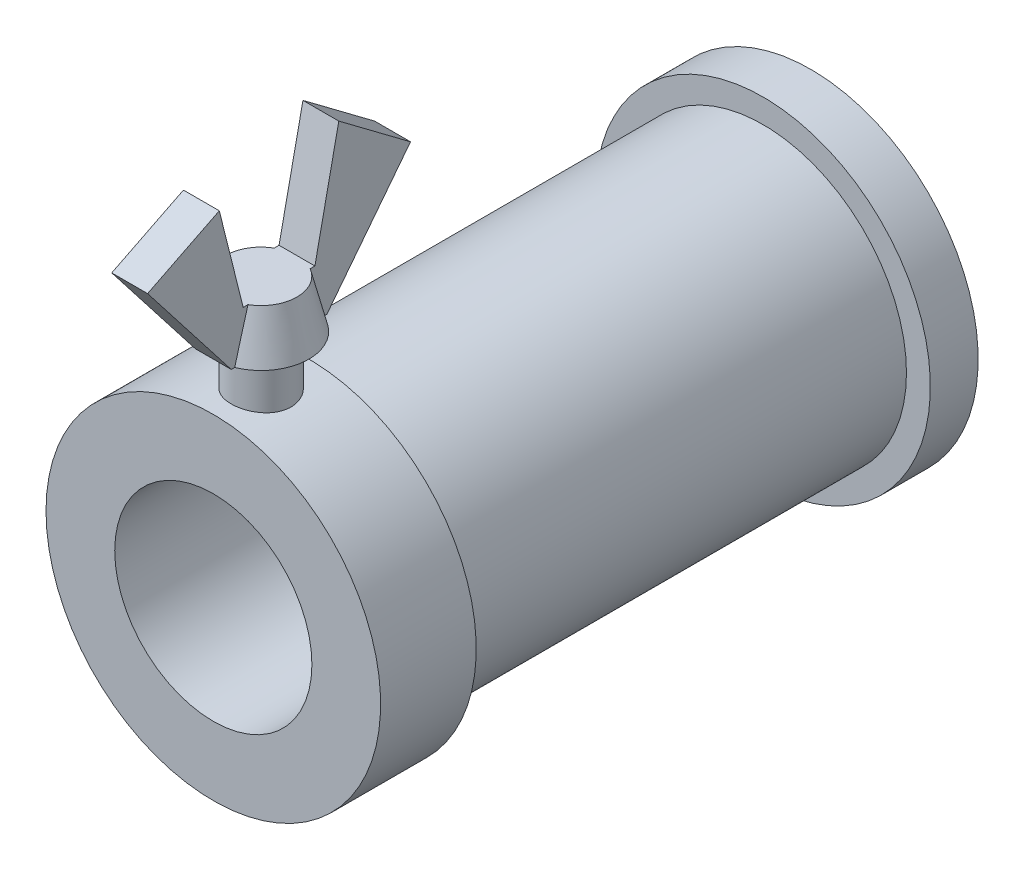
ISO-10303-21;
HEADER;
FILE_DESCRIPTION(('STEP AP214'),'2;1');
FILE_NAME('part.step','',(''),(''),'','','');
FILE_SCHEMA(('AUTOMOTIVE_DESIGN { 1 0 10303 214 1 1 1 1 }'));
ENDSEC;
DATA;
#1=APPLICATION_CONTEXT('core data for automotive mechanical design processes');
#2=APPLICATION_PROTOCOL_DEFINITION('international standard','automotive_design',2000,#1);
#3=PRODUCT_CONTEXT('',#1,'mechanical');
#4=PRODUCT('Part','Part','',(#3));
#5=PRODUCT_RELATED_PRODUCT_CATEGORY('part','',(#4));
#6=PRODUCT_DEFINITION_FORMATION('','',#4);
#7=PRODUCT_DEFINITION_CONTEXT('part definition',#1,'design');
#8=PRODUCT_DEFINITION('design','',#6,#7);
#9=PRODUCT_DEFINITION_SHAPE('','',#8);
#10=(LENGTH_UNIT() NAMED_UNIT(*) SI_UNIT(.MILLI.,.METRE.));
#11=(NAMED_UNIT(*) PLANE_ANGLE_UNIT() SI_UNIT($,.RADIAN.));
#12=(NAMED_UNIT(*) SI_UNIT($,.STERADIAN.) SOLID_ANGLE_UNIT());
#13=UNCERTAINTY_MEASURE_WITH_UNIT(LENGTH_MEASURE(1.E-05),#10,'distance_accuracy_value','');
#14=(GEOMETRIC_REPRESENTATION_CONTEXT(3) GLOBAL_UNCERTAINTY_ASSIGNED_CONTEXT((#13)) GLOBAL_UNIT_ASSIGNED_CONTEXT((#10,
#11,#12)) REPRESENTATION_CONTEXT('',''));
#15=CARTESIAN_POINT('',(0.,0.,0.));
#16=DIRECTION('',(0.,0.,1.));
#17=DIRECTION('',(1.,0.,0.));
#18=AXIS2_PLACEMENT_3D('',#15,#16,#17);
#19=CARTESIAN_POINT('',(0.,22.,46.));
#20=DIRECTION('',(0.,-1.,0.));
#21=DIRECTION('',(0.,0.,1.));
#22=AXIS2_PLACEMENT_3D('',#19,#20,#21);
#23=CONICAL_SURFACE('',#22,3.,0.244978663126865);
#24=CARTESIAN_POINT('',(-1.5,24.8634565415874,47.7225784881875));
#25=CARTESIAN_POINT('',(-1.5,24.7179564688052,47.7707943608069));
#26=CARTESIAN_POINT('',(-1.5,24.5722086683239,47.8182542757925));
#27=CARTESIAN_POINT('',(-1.5,24.2803109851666,47.9119099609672));
#28=CARTESIAN_POINT('',(-1.5,24.13416111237,47.9581057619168));
#29=CARTESIAN_POINT('',(-1.5,23.8415562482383,48.0494799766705));
#30=CARTESIAN_POINT('',(-1.5,23.6951012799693,48.0946584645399));
#31=CARTESIAN_POINT('',(-1.5,23.401932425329,48.1841702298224));
#32=CARTESIAN_POINT('',(-1.5,23.2552185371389,48.2285035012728));
#33=CARTESIAN_POINT('',(-1.5,22.8148083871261,48.3604319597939));
#34=CARTESIAN_POINT('',(-1.5,22.5207956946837,48.4469706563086));
#35=CARTESIAN_POINT('',(-1.5,21.9321710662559,48.617999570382));
#36=CARTESIAN_POINT('',(-1.5,21.6375591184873,48.70248974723));
#37=CARTESIAN_POINT('',(-1.5,21.1572394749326,48.8388644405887));
#38=CARTESIAN_POINT('',(-1.5,20.9716653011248,48.8912200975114));
#39=CARTESIAN_POINT('',(-1.5,20.6003702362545,48.9954030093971));
#40=CARTESIAN_POINT('',(-1.5,20.4146493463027,49.0472302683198));
#41=CARTESIAN_POINT('',(-1.5,19.8572788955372,49.2020403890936));
#42=CARTESIAN_POINT('',(-1.5,19.4854412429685,49.3043460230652));
#43=CARTESIAN_POINT('',(-1.5,18.6318117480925,49.5375328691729));
#44=CARTESIAN_POINT('',(-1.5,18.1498946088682,49.6679546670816));
#45=CARTESIAN_POINT('',(-1.5,17.1856155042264,49.9271461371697));
#46=CARTESIAN_POINT('',(-1.5,16.7032535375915,50.0559158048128));
#47=CARTESIAN_POINT('',(-1.5,15.7382755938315,50.3121964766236));
#48=CARTESIAN_POINT('',(-1.5,15.2556596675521,50.439707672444));
#49=CARTESIAN_POINT('',(-1.5,14.2901756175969,50.6937568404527));
#50=CARTESIAN_POINT('',(-1.5,13.8073074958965,50.8202948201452));
#51=CARTESIAN_POINT('',(-1.5,13.3243477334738,50.9464797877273));
#52=B_SPLINE_CURVE_WITH_KNOTS('',3,(#24,#25,#26,#27,#28,#29,#30,#31,#32,#33,#34,#35,#36,#37,#38,
#39,#40,#41,#42,#43,#44,#45,#46,#47,#48,#49,#50,#51),.UNSPECIFIED.,.F.,.F.,(4,2,2,2,2,2,2,2,2,2,
2,2,2,4),(0.,0.459836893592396,0.919662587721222,1.3794546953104,1.83925004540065,
2.75869016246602,3.6781485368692,4.25660258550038,4.8350522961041,5.99201310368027,
7.48976928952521,8.98752958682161,10.4850581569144,11.982575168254),.UNSPECIFIED.);
#53=CARTESIAN_POINT('',(-1.5,22.,48.5980762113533));
#54=VERTEX_POINT('',#53);
#55=CARTESIAN_POINT('',(-1.5,18.,49.7080992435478));
#56=VERTEX_POINT('',#55);
#57=EDGE_CURVE('E292',#54,#56,#52,.T.);
#58=ORIENTED_EDGE('',*,*,#57,.F.);
#59=CARTESIAN_POINT('',(0.,22.,46.));
#60=DIRECTION('',(0.,-1.,0.));
#61=DIRECTION('',(0.,0.,1.));
#62=AXIS2_PLACEMENT_3D('',#59,#60,#61);
#63=CIRCLE('',#62,3.);
#64=CARTESIAN_POINT('',(-1.5,22.,43.4019237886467));
#65=VERTEX_POINT('',#64);
#66=EDGE_CURVE('E189',#54,#65,#63,.T.);
#67=ORIENTED_EDGE('',*,*,#66,.T.);
#68=CARTESIAN_POINT('',(-1.5,13.3243477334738,41.0535202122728));
#69=CARTESIAN_POINT('',(-1.5,13.8073880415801,41.1797262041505));
#70=CARTESIAN_POINT('',(-1.5,14.2903366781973,41.3062853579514));
#71=CARTESIAN_POINT('',(-1.5,15.2559717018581,41.5603746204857));
#72=CARTESIAN_POINT('',(-1.5,15.7386580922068,41.6879047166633));
#73=CARTESIAN_POINT('',(-1.5,16.7036262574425,41.9441835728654));
#74=CARTESIAN_POINT('',(-1.5,17.1859080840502,42.0729321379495));
#75=CARTESIAN_POINT('',(-1.5,18.1500361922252,42.3320837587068));
#76=CARTESIAN_POINT('',(-1.5,18.6318824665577,42.4624868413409));
#77=CARTESIAN_POINT('',(-1.5,19.5950544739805,42.7255967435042));
#78=CARTESIAN_POINT('',(-1.5,20.0763800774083,42.8583040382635));
#79=CARTESIAN_POINT('',(-1.5,21.038107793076,43.12697047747));
#80=CARTESIAN_POINT('',(-1.5,21.5185099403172,43.2629294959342));
#81=CARTESIAN_POINT('',(-1.5,22.2380729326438,43.4706495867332));
#82=CARTESIAN_POINT('',(-1.5,22.4777770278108,43.5405268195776));
#83=CARTESIAN_POINT('',(-1.5,22.9567027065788,43.6819038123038));
#84=CARTESIAN_POINT('',(-1.5,23.1959242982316,43.7534035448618));
#85=CARTESIAN_POINT('',(-1.5,23.6737573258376,43.898533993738));
#86=CARTESIAN_POINT('',(-1.5,23.9123686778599,43.972164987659));
#87=CARTESIAN_POINT('',(-1.5,24.2696087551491,44.0847837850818));
#88=CARTESIAN_POINT('',(-1.5,24.3885793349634,44.1226865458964));
#89=CARTESIAN_POINT('',(-1.5,24.62624120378,44.199363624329));
#90=CARTESIAN_POINT('',(-1.5,24.7449324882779,44.2381379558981));
#91=CARTESIAN_POINT('',(-1.5,24.8634565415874,44.2774215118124));
#92=B_SPLINE_CURVE_WITH_KNOTS('',3,(#68,#69,#70,#71,#72,#73,#74,#75,#76,#77,#78,#79,#80,#81,#82,
#83,#84,#85,#86,#87,#88,#89,#90,#91),.UNSPECIFIED.,.F.,.F.,(4,2,2,2,2,2,2,2,2,2,2,4),(0.,
1.49776676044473,2.99551418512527,4.49302590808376,5.99056206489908,7.48841083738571,
8.9862016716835,9.7352420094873,10.4842697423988,11.2333954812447,11.6079796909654,
11.9825699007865),.UNSPECIFIED.);
#93=CARTESIAN_POINT('',(-1.5,18.,42.2919007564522));
#94=VERTEX_POINT('',#93);
#95=EDGE_CURVE('E218',#94,#65,#92,.T.);
#96=ORIENTED_EDGE('',*,*,#95,.F.);
#97=CARTESIAN_POINT('',(0.,18.,46.));
#98=DIRECTION('',(0.,-1.,0.));
#99=DIRECTION('',(0.,0.,1.));
#100=AXIS2_PLACEMENT_3D('',#97,#98,#99);
#101=CIRCLE('',#100,4.);
#102=EDGE_CURVE('E187',#56,#94,#101,.T.);
#103=ORIENTED_EDGE('',*,*,#102,.F.);
#104=EDGE_LOOP('',(#58,#67,#96,#103));
#105=FACE_BOUND('',#104,.T.);
#106=ADVANCED_FACE('F14',(#105),#23,.T.);
#107=CARTESIAN_POINT('',(-14.,0.,0.));
#108=DIRECTION('',(0.,0.,1.));
#109=DIRECTION('',(1.,0.,0.));
#110=AXIS2_PLACEMENT_3D('',#107,#108,#109);
#111=PLANE('',#110);
#112=CARTESIAN_POINT('',(0.,0.,0.));
#113=DIRECTION('',(0.,0.,-1.));
#114=DIRECTION('',(-1.,0.,0.));
#115=AXIS2_PLACEMENT_3D('',#112,#113,#114);
#116=CIRCLE('',#115,8.25);
#117=CARTESIAN_POINT('',(-8.25,0.,0.));
#118=VERTEX_POINT('',#117);
#119=EDGE_CURVE('E215',#118,#118,#116,.T.);
#120=ORIENTED_EDGE('',*,*,#119,.F.);
#121=EDGE_LOOP('',(#120));
#122=FACE_BOUND('',#121,.T.);
#123=CARTESIAN_POINT('',(0.,0.,0.));
#124=DIRECTION('',(0.,0.,-1.));
#125=DIRECTION('',(-1.,0.,0.));
#126=AXIS2_PLACEMENT_3D('',#123,#124,#125);
#127=CIRCLE('',#126,14.);
#128=CARTESIAN_POINT('',(-14.,0.,0.));
#129=VERTEX_POINT('',#128);
#130=EDGE_CURVE('E194',#129,#129,#127,.T.);
#131=ORIENTED_EDGE('',*,*,#130,.T.);
#132=EDGE_LOOP('',(#131));
#133=FACE_BOUND('',#132,.T.);
#134=ADVANCED_FACE('F16',(#122,#133),#111,.F.);
#135=CARTESIAN_POINT('',(0.,0.,-10.));
#136=DIRECTION('',(0.,0.,-1.));
#137=DIRECTION('',(-1.,0.,0.));
#138=AXIS2_PLACEMENT_3D('',#135,#136,#137);
#139=CYLINDRICAL_SURFACE('',#138,8.25);
#140=CARTESIAN_POINT('',(0.,0.,50.));
#141=DIRECTION('',(0.,0.,-1.));
#142=DIRECTION('',(-1.,0.,0.));
#143=AXIS2_PLACEMENT_3D('',#140,#141,#142);
#144=CIRCLE('',#143,8.25);
#145=CARTESIAN_POINT('',(-8.25,0.,50.));
#146=VERTEX_POINT('',#145);
#147=EDGE_CURVE('E212',#146,#146,#144,.T.);
#148=ORIENTED_EDGE('',*,*,#147,.F.);
#149=EDGE_LOOP('',(#148));
#150=FACE_BOUND('',#149,.T.);
#151=ORIENTED_EDGE('',*,*,#119,.T.);
#152=EDGE_LOOP('',(#151));
#153=FACE_BOUND('',#152,.T.);
#154=ADVANCED_FACE('F275',(#150,#153),#139,.F.);
#155=CARTESIAN_POINT('',(-8.25,0.,50.));
#156=DIRECTION('',(0.,0.,-1.));
#157=DIRECTION('',(-1.,0.,0.));
#158=AXIS2_PLACEMENT_3D('',#155,#156,#157);
#159=PLANE('',#158);
#160=CARTESIAN_POINT('',(0.,0.,50.));
#161=DIRECTION('',(0.,0.,-1.));
#162=DIRECTION('',(-1.,0.,0.));
#163=AXIS2_PLACEMENT_3D('',#160,#161,#162);
#164=CIRCLE('',#163,14.);
#165=CARTESIAN_POINT('',(-14.,0.,50.));
#166=VERTEX_POINT('',#165);
#167=EDGE_CURVE('E209',#166,#166,#164,.T.);
#168=ORIENTED_EDGE('',*,*,#167,.F.);
#169=EDGE_LOOP('',(#168));
#170=FACE_BOUND('',#169,.T.);
#171=ORIENTED_EDGE('',*,*,#147,.T.);
#172=EDGE_LOOP('',(#171));
#173=FACE_BOUND('',#172,.T.);
#174=ADVANCED_FACE('F265',(#170,#173),#159,.F.);
#175=CARTESIAN_POINT('',(0.,0.,-10.));
#176=DIRECTION('',(0.,0.,-1.));
#177=DIRECTION('',(-1.,0.,0.));
#178=AXIS2_PLACEMENT_3D('',#175,#176,#177);
#179=CYLINDRICAL_SURFACE('',#178,14.);
#180=CARTESIAN_POINT('',(0.,14.,48.5));
#181=CARTESIAN_POINT('',(-0.139239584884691,13.9999975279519,48.4999945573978));
#182=CARTESIAN_POINT('',(-0.278551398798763,13.9979012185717,48.4883280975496));
#183=CARTESIAN_POINT('',(-0.553257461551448,13.9897405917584,48.4419958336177));
#184=CARTESIAN_POINT('',(-0.688648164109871,13.9836727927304,48.4073098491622));
#185=CARTESIAN_POINT('',(-0.951498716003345,13.9682487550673,48.316027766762));
#186=CARTESIAN_POINT('',(-1.07896532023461,13.9588953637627,48.2594506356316));
#187=CARTESIAN_POINT('',(-1.32258294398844,13.9379246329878,48.1260443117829));
#188=CARTESIAN_POINT('',(-1.43873504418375,13.9263075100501,48.0492170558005));
#189=CARTESIAN_POINT('',(-1.65770744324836,13.9019523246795,47.8766007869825));
#190=CARTESIAN_POINT('',(-1.76038642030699,13.8892044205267,47.7806338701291));
#191=CARTESIAN_POINT('',(-1.94827611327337,13.8640984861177,47.5728452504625));
#192=CARTESIAN_POINT('',(-2.03348564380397,13.851740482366,47.4610224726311));
#193=CARTESIAN_POINT('',(-2.18459604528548,13.828718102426,47.2237098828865));
#194=CARTESIAN_POINT('',(-2.2503549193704,13.8180664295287,47.098128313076));
#195=CARTESIAN_POINT('',(-2.35978878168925,13.799800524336,46.8374788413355));
#196=CARTESIAN_POINT('',(-2.40346549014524,13.7921860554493,46.7024116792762));
#197=CARTESIAN_POINT('',(-2.46704527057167,13.7809553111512,46.4281311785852));
#198=CARTESIAN_POINT('',(-2.48719373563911,13.7772977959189,46.2889764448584));
#199=CARTESIAN_POINT('',(-2.50390640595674,13.7742705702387,46.0092170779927));
#200=CARTESIAN_POINT('',(-2.50047252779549,13.7749005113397,45.8686125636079));
#201=CARTESIAN_POINT('',(-2.47031736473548,13.78033942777,45.5917111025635));
#202=CARTESIAN_POINT('',(-2.44387361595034,13.7850985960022,45.4553828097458));
#203=CARTESIAN_POINT('',(-2.3688857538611,13.7981816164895,45.1891293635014));
#204=CARTESIAN_POINT('',(-2.3203407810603,13.8065056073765,45.0592044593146));
#205=CARTESIAN_POINT('',(-2.2022526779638,13.8258332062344,44.8086255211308));
#206=CARTESIAN_POINT('',(-2.13259607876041,13.836851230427,44.6880261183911));
#207=CARTESIAN_POINT('',(-1.97434240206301,13.8603157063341,44.4601224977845));
#208=CARTESIAN_POINT('',(-1.88574357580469,13.8727622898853,44.3528195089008));
#209=CARTESIAN_POINT('',(-1.69061708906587,13.8978993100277,44.1529497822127));
#210=CARTESIAN_POINT('',(-1.58385171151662,13.9105906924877,44.0606150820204));
#211=CARTESIAN_POINT('',(-1.35622200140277,13.934623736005,43.895133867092));
#212=CARTESIAN_POINT('',(-1.23535755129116,13.9459653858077,43.8219875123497));
#213=CARTESIAN_POINT('',(-0.982729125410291,13.9660408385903,43.6969309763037));
#214=CARTESIAN_POINT('',(-0.850953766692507,13.9747718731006,43.6450433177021));
#215=CARTESIAN_POINT('',(-0.580367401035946,13.9886206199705,43.564203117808));
#216=CARTESIAN_POINT('',(-0.441557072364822,13.9937386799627,43.5352483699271));
#217=CARTESIAN_POINT('',(-0.16283898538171,13.999737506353,43.501415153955));
#218=CARTESIAN_POINT('',(-0.0229710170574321,14.0006742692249,43.496218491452));
#219=CARTESIAN_POINT('',(0.255635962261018,13.9983590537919,43.5091977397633));
#220=CARTESIAN_POINT('',(0.394375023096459,13.9951072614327,43.5273726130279));
#221=CARTESIAN_POINT('',(0.66578830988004,13.9848150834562,43.5863143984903));
#222=CARTESIAN_POINT('',(0.798498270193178,13.9778014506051,43.6269218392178));
#223=CARTESIAN_POINT('',(1.05522666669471,13.960768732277,43.7294046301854));
#224=CARTESIAN_POINT('',(1.17924455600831,13.9507494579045,43.7912813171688));
#225=CARTESIAN_POINT('',(1.4164370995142,13.9286773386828,43.9352612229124));
#226=CARTESIAN_POINT('',(1.52949072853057,13.9166051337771,44.0175607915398));
#227=CARTESIAN_POINT('',(1.74029662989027,13.8918196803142,44.1997826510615));
#228=CARTESIAN_POINT('',(1.8380476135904,13.8791063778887,44.2997064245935));
#229=CARTESIAN_POINT('',(2.01666949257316,13.8542878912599,44.5157749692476));
#230=CARTESIAN_POINT('',(2.09732417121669,13.8421918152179,44.6320997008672));
#231=CARTESIAN_POINT('',(2.237948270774,13.8201546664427,44.8768336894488));
#232=CARTESIAN_POINT('',(2.29791841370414,13.8102135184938,45.0052425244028));
#233=CARTESIAN_POINT('',(2.39515706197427,13.7936819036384,45.2699261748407));
#234=CARTESIAN_POINT('',(2.43252842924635,13.7870762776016,45.4061622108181));
#235=CARTESIAN_POINT('',(2.48382895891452,13.7779274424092,45.6831072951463));
#236=CARTESIAN_POINT('',(2.49776049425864,13.7753838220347,45.8238158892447));
#237=CARTESIAN_POINT('',(2.50171229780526,13.7746664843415,46.1035492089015));
#238=CARTESIAN_POINT('',(2.49207328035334,13.7764304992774,46.2425690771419));
#239=CARTESIAN_POINT('',(2.44989946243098,13.7839923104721,46.5169738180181));
#240=CARTESIAN_POINT('',(2.41736476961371,13.7897900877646,46.6523587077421));
#241=CARTESIAN_POINT('',(2.33046113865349,13.8047410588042,46.9154898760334));
#242=CARTESIAN_POINT('',(2.27612576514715,13.8138890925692,47.0432475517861));
#243=CARTESIAN_POINT('',(2.14719934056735,13.8345140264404,47.2878884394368));
#244=CARTESIAN_POINT('',(2.07260704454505,13.8459910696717,47.4047709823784));
#245=CARTESIAN_POINT('',(1.90408567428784,13.8701759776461,47.62605704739));
#246=CARTESIAN_POINT('',(1.80990741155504,13.882898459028,47.7302692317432));
#247=CARTESIAN_POINT('',(1.60540999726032,13.9080282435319,47.9215258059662));
#248=CARTESIAN_POINT('',(1.49508713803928,13.920435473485,48.0085662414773));
#249=CARTESIAN_POINT('',(1.26037074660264,13.9436534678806,48.1636577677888));
#250=CARTESIAN_POINT('',(1.13587103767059,13.9544505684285,48.2315502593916));
#251=CARTESIAN_POINT('',(0.877084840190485,13.9730987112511,48.3453492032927));
#252=CARTESIAN_POINT('',(0.742807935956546,13.9809525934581,48.3912768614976));
#253=CARTESIAN_POINT('',(0.506731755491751,13.9911779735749,48.4502306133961));
#254=CARTESIAN_POINT('',(0.406334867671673,13.9944679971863,48.4688631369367));
#255=CARTESIAN_POINT('',(0.203971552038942,13.9988798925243,48.4937496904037));
#256=CARTESIAN_POINT('',(0.102005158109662,14.0000018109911,48.5000039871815));
#257=CARTESIAN_POINT('',(0.,14.,48.5));
#258=B_SPLINE_CURVE_WITH_KNOTS('',3,(#180,#181,#182,#183,#184,#185,#186,#187,#188,#189,#190,
#191,#192,#193,#194,#195,#196,#197,#198,#199,#200,#201,#202,#203,#204,#205,#206,#207,#208,#209,
#210,#211,#212,#213,#214,#215,#216,#217,#218,#219,#220,#221,#222,#223,#224,#225,#226,#227,#228,
#229,#230,#231,#232,#233,#234,#235,#236,#237,#238,#239,#240,#241,#242,#243,#244,#245,#246,#247,
#248,#249,#250,#251,#252,#253,#254,#255,#256,#257),.UNSPECIFIED.,.T.,.F.,(4,2,2,2,2,2,2,2,2,2,2,
2,2,2,2,2,2,2,2,2,2,2,2,2,2,2,2,2,2,2,2,2,2,2,2,2,2,2,4),(0.,0.417345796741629,
0.835057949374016,1.25240899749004,1.66972014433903,2.09110796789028,2.51252437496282,
2.93694536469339,3.36133328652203,3.78125426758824,4.20114112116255,4.61603258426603,
5.03094018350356,5.44811857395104,5.86533549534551,6.28850377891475,6.71167559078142,
7.13529458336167,7.55887281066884,7.97676106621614,8.39463077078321,8.80956740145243,
9.22453011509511,9.64364840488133,10.062801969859,10.4869762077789,10.9111356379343,
11.3333496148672,11.7555208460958,12.1716257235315,12.5877286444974,13.0031933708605,
13.4186836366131,13.8398246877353,14.2610626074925,14.6856934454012,15.109913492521,
15.4156623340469,15.7214045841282),.UNSPECIFIED.);
#259=CARTESIAN_POINT('',(0.,14.,48.5));
#260=VERTEX_POINT('',#259);
#261=EDGE_CURVE('E193',#260,#260,#258,.T.);
#262=ORIENTED_EDGE('',*,*,#261,.T.);
#263=EDGE_LOOP('',(#262));
#264=FACE_BOUND('',#263,.T.);
#265=CARTESIAN_POINT('',(0.,0.,42.));
#266=DIRECTION('',(0.,0.,-1.));
#267=DIRECTION('',(-1.,0.,0.));
#268=AXIS2_PLACEMENT_3D('',#265,#266,#267);
#269=CIRCLE('',#268,14.);
#270=CARTESIAN_POINT('',(-14.,0.,42.));
#271=VERTEX_POINT('',#270);
#272=EDGE_CURVE('E206',#271,#271,#269,.T.);
#273=ORIENTED_EDGE('',*,*,#272,.F.);
#274=EDGE_LOOP('',(#273));
#275=FACE_BOUND('',#274,.T.);
#276=ORIENTED_EDGE('',*,*,#167,.T.);
#277=EDGE_LOOP('',(#276));
#278=FACE_BOUND('',#277,.T.);
#279=ADVANCED_FACE('F232',(#264,#275,#278),#179,.T.);
#280=CARTESIAN_POINT('',(-14.,0.,42.));
#281=DIRECTION('',(0.,0.,1.));
#282=DIRECTION('',(1.,0.,0.));
#283=AXIS2_PLACEMENT_3D('',#280,#281,#282);
#284=PLANE('',#283);
#285=CARTESIAN_POINT('',(0.,0.,42.));
#286=DIRECTION('',(0.,0.,-1.));
#287=DIRECTION('',(-1.,0.,0.));
#288=AXIS2_PLACEMENT_3D('',#285,#286,#287);
#289=CIRCLE('',#288,12.);
#290=CARTESIAN_POINT('',(-12.,0.,42.));
#291=VERTEX_POINT('',#290);
#292=EDGE_CURVE('E203',#291,#291,#289,.T.);
#293=ORIENTED_EDGE('',*,*,#292,.F.);
#294=EDGE_LOOP('',(#293));
#295=FACE_BOUND('',#294,.T.);
#296=ORIENTED_EDGE('',*,*,#272,.T.);
#297=EDGE_LOOP('',(#296));
#298=FACE_BOUND('',#297,.T.);
#299=ADVANCED_FACE('F257',(#295,#298),#284,.F.);
#300=CARTESIAN_POINT('',(0.,0.,-10.));
#301=DIRECTION('',(0.,0.,-1.));
#302=DIRECTION('',(-1.,0.,0.));
#303=AXIS2_PLACEMENT_3D('',#300,#301,#302);
#304=CYLINDRICAL_SURFACE('',#303,12.);
#305=CARTESIAN_POINT('',(0.,0.,4.));
#306=DIRECTION('',(0.,0.,-1.));
#307=DIRECTION('',(-1.,0.,0.));
#308=AXIS2_PLACEMENT_3D('',#305,#306,#307);
#309=CIRCLE('',#308,12.);
#310=CARTESIAN_POINT('',(-12.,0.,4.));
#311=VERTEX_POINT('',#310);
#312=EDGE_CURVE('E200',#311,#311,#309,.T.);
#313=ORIENTED_EDGE('',*,*,#312,.F.);
#314=EDGE_LOOP('',(#313));
#315=FACE_BOUND('',#314,.T.);
#316=ORIENTED_EDGE('',*,*,#292,.T.);
#317=EDGE_LOOP('',(#316));
#318=FACE_BOUND('',#317,.T.);
#319=ADVANCED_FACE('F254',(#315,#318),#304,.T.);
#320=CARTESIAN_POINT('',(-12.,0.,4.));
#321=DIRECTION('',(0.,0.,-1.));
#322=DIRECTION('',(-1.,0.,0.));
#323=AXIS2_PLACEMENT_3D('',#320,#321,#322);
#324=PLANE('',#323);
#325=CARTESIAN_POINT('',(0.,0.,4.));
#326=DIRECTION('',(0.,0.,-1.));
#327=DIRECTION('',(-1.,0.,0.));
#328=AXIS2_PLACEMENT_3D('',#325,#326,#327);
#329=CIRCLE('',#328,14.);
#330=CARTESIAN_POINT('',(-14.,0.,4.));
#331=VERTEX_POINT('',#330);
#332=EDGE_CURVE('E197',#331,#331,#329,.T.);
#333=ORIENTED_EDGE('',*,*,#332,.F.);
#334=EDGE_LOOP('',(#333));
#335=FACE_BOUND('',#334,.T.);
#336=ORIENTED_EDGE('',*,*,#312,.T.);
#337=EDGE_LOOP('',(#336));
#338=FACE_BOUND('',#337,.T.);
#339=ADVANCED_FACE('F250',(#335,#338),#324,.F.);
#340=CARTESIAN_POINT('',(0.,0.,-10.));
#341=DIRECTION('',(0.,0.,-1.));
#342=DIRECTION('',(-1.,0.,0.));
#343=AXIS2_PLACEMENT_3D('',#340,#341,#342);
#344=CYLINDRICAL_SURFACE('',#343,14.);
#345=ORIENTED_EDGE('',*,*,#130,.F.);
#346=EDGE_LOOP('',(#345));
#347=FACE_BOUND('',#346,.T.);
#348=ORIENTED_EDGE('',*,*,#332,.T.);
#349=EDGE_LOOP('',(#348));
#350=FACE_BOUND('',#349,.T.);
#351=ADVANCED_FACE('F242',(#347,#350),#344,.T.);
#352=CARTESIAN_POINT('',(0.,-20.,46.));
#353=DIRECTION('',(0.,-1.,0.));
#354=DIRECTION('',(0.,0.,1.));
#355=AXIS2_PLACEMENT_3D('',#352,#353,#354);
#356=CYLINDRICAL_SURFACE('',#355,2.5);
#357=CARTESIAN_POINT('',(0.,18.,46.));
#358=DIRECTION('',(0.,-1.,0.));
#359=DIRECTION('',(0.,0.,1.));
#360=AXIS2_PLACEMENT_3D('',#357,#358,#359);
#361=CIRCLE('',#360,2.5);
#362=CARTESIAN_POINT('',(0.,18.,48.5));
#363=VERTEX_POINT('',#362);
#364=EDGE_CURVE('E190',#363,#363,#361,.T.);
#365=ORIENTED_EDGE('',*,*,#364,.T.);
#366=EDGE_LOOP('',(#365));
#367=FACE_BOUND('',#366,.T.);
#368=ORIENTED_EDGE('',*,*,#261,.F.);
#369=EDGE_LOOP('',(#368));
#370=FACE_BOUND('',#369,.T.);
#371=ADVANCED_FACE('F236',(#367,#370),#356,.T.);
#372=CARTESIAN_POINT('',(0.,18.,42.));
#373=DIRECTION('',(0.,1.,0.));
#374=DIRECTION('',(0.,0.,-1.));
#375=AXIS2_PLACEMENT_3D('',#372,#373,#374);
#376=PLANE('',#375);
#377=ORIENTED_EDGE('',*,*,#364,.F.);
#378=EDGE_LOOP('',(#377));
#379=FACE_BOUND('',#378,.T.);
#380=CARTESIAN_POINT('',(1.5,18.,42.2919007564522));
#381=VERTEX_POINT('',#380);
#382=CARTESIAN_POINT('',(1.5,18.,49.7080992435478));
#383=VERTEX_POINT('',#382);
#384=EDGE_CURVE('E116',#381,#383,#101,.T.);
#385=ORIENTED_EDGE('',*,*,#384,.T.);
#386=DIRECTION('',(0.,0.,1.));
#387=VECTOR('',#386,1.);
#388=CARTESIAN_POINT('',(1.5,18.,42.));
#389=LINE('',#388,#387);
#390=CARTESIAN_POINT('',(1.5,18.,50.));
#391=VERTEX_POINT('',#390);
#392=EDGE_CURVE('E143',#383,#391,#389,.T.);
#393=ORIENTED_EDGE('',*,*,#392,.T.);
#394=DIRECTION('',(1.,0.,0.));
#395=VECTOR('',#394,1.);
#396=CARTESIAN_POINT('',(-1.5,18.,50.));
#397=LINE('',#396,#395);
#398=CARTESIAN_POINT('',(-1.5,18.,50.));
#399=VERTEX_POINT('',#398);
#400=EDGE_CURVE('E180',#399,#391,#397,.T.);
#401=ORIENTED_EDGE('',*,*,#400,.F.);
#402=DIRECTION('',(0.,0.,1.));
#403=VECTOR('',#402,1.);
#404=CARTESIAN_POINT('',(-1.5,18.,42.));
#405=LINE('',#404,#403);
#406=EDGE_CURVE('E165',#56,#399,#405,.T.);
#407=ORIENTED_EDGE('',*,*,#406,.F.);
#408=ORIENTED_EDGE('',*,*,#102,.T.);
#409=CARTESIAN_POINT('',(-1.5,18.,42.));
#410=VERTEX_POINT('',#409);
#411=EDGE_CURVE('E157',#410,#94,#405,.T.);
#412=ORIENTED_EDGE('',*,*,#411,.F.);
#413=DIRECTION('',(1.,0.,0.));
#414=VECTOR('',#413,1.);
#415=CARTESIAN_POINT('',(-1.5,18.,42.));
#416=LINE('',#415,#414);
#417=CARTESIAN_POINT('',(1.5,18.,42.));
#418=VERTEX_POINT('',#417);
#419=EDGE_CURVE('E182',#410,#418,#416,.T.);
#420=ORIENTED_EDGE('',*,*,#419,.T.);
#421=EDGE_CURVE('E133',#418,#381,#389,.T.);
#422=ORIENTED_EDGE('',*,*,#421,.T.);
#423=EDGE_LOOP('',(#385,#393,#401,#407,#408,#412,#420,#422));
#424=FACE_BOUND('',#423,.T.);
#425=ADVANCED_FACE('F241',(#379,#424),#376,.F.);
#426=CARTESIAN_POINT('',(0.,22.,43.));
#427=DIRECTION('',(0.,1.,0.));
#428=DIRECTION('',(0.,0.,-1.));
#429=AXIS2_PLACEMENT_3D('',#426,#427,#428);
#430=PLANE('',#429);
#431=CARTESIAN_POINT('',(1.5,22.,43.4019237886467));
#432=VERTEX_POINT('',#431);
#433=CARTESIAN_POINT('',(1.5,22.,48.5980762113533));
#434=VERTEX_POINT('',#433);
#435=EDGE_CURVE('E34',#432,#434,#63,.T.);
#436=ORIENTED_EDGE('',*,*,#435,.F.);
#437=DIRECTION('',(0.,0.,1.));
#438=VECTOR('',#437,1.);
#439=CARTESIAN_POINT('',(1.5,22.,43.));
#440=LINE('',#439,#438);
#441=CARTESIAN_POINT('',(1.5,22.,43.));
#442=VERTEX_POINT('',#441);
#443=EDGE_CURVE('E136',#442,#432,#440,.T.);
#444=ORIENTED_EDGE('',*,*,#443,.F.);
#445=DIRECTION('',(1.,0.,0.));
#446=VECTOR('',#445,1.);
#447=CARTESIAN_POINT('',(-1.5,22.,43.));
#448=LINE('',#447,#446);
#449=CARTESIAN_POINT('',(-1.5,22.,43.));
#450=VERTEX_POINT('',#449);
#451=EDGE_CURVE('E122',#450,#442,#448,.T.);
#452=ORIENTED_EDGE('',*,*,#451,.F.);
#453=DIRECTION('',(0.,0.,1.));
#454=VECTOR('',#453,1.);
#455=CARTESIAN_POINT('',(-1.5,22.,43.));
#456=LINE('',#455,#454);
#457=EDGE_CURVE('E158',#450,#65,#456,.T.);
#458=ORIENTED_EDGE('',*,*,#457,.T.);
#459=ORIENTED_EDGE('',*,*,#66,.F.);
#460=CARTESIAN_POINT('',(-1.5,22.,49.));
#461=VERTEX_POINT('',#460);
#462=EDGE_CURVE('E126',#54,#461,#456,.T.);
#463=ORIENTED_EDGE('',*,*,#462,.T.);
#464=DIRECTION('',(1.,0.,0.));
#465=VECTOR('',#464,1.);
#466=CARTESIAN_POINT('',(-1.5,22.,49.));
#467=LINE('',#466,#465);
#468=CARTESIAN_POINT('',(1.5,22.,49.));
#469=VERTEX_POINT('',#468);
#470=EDGE_CURVE('E174',#461,#469,#467,.T.);
#471=ORIENTED_EDGE('',*,*,#470,.T.);
#472=EDGE_CURVE('E139',#434,#469,#440,.T.);
#473=ORIENTED_EDGE('',*,*,#472,.F.);
#474=EDGE_LOOP('',(#436,#444,#452,#458,#459,#463,#471,#473));
#475=FACE_BOUND('',#474,.T.);
#476=ADVANCED_FACE('F244',(#475),#430,.T.);
#477=ORIENTED_EDGE('',*,*,#435,.T.);
#478=CARTESIAN_POINT('',(1.5,24.8634565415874,47.7225784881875));
#479=CARTESIAN_POINT('',(1.5,24.7179564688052,47.7707943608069));
#480=CARTESIAN_POINT('',(1.5,24.5722086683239,47.8182542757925));
#481=CARTESIAN_POINT('',(1.5,24.2803109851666,47.9119099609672));
#482=CARTESIAN_POINT('',(1.5,24.13416111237,47.9581057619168));
#483=CARTESIAN_POINT('',(1.5,23.8415562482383,48.0494799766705));
#484=CARTESIAN_POINT('',(1.5,23.6951012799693,48.0946584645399));
#485=CARTESIAN_POINT('',(1.5,23.401932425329,48.1841702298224));
#486=CARTESIAN_POINT('',(1.5,23.2552185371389,48.2285035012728));
#487=CARTESIAN_POINT('',(1.5,22.8148083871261,48.3604319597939));
#488=CARTESIAN_POINT('',(1.5,22.5207956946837,48.4469706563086));
#489=CARTESIAN_POINT('',(1.5,21.9321710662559,48.617999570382));
#490=CARTESIAN_POINT('',(1.5,21.6375591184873,48.70248974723));
#491=CARTESIAN_POINT('',(1.5,21.1572394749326,48.8388644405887));
#492=CARTESIAN_POINT('',(1.5,20.9716653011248,48.8912200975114));
#493=CARTESIAN_POINT('',(1.5,20.6003702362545,48.9954030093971));
#494=CARTESIAN_POINT('',(1.5,20.4146493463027,49.0472302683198));
#495=CARTESIAN_POINT('',(1.5,19.8572788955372,49.2020403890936));
#496=CARTESIAN_POINT('',(1.5,19.4854412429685,49.3043460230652));
#497=CARTESIAN_POINT('',(1.5,18.6318117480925,49.5375328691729));
#498=CARTESIAN_POINT('',(1.5,18.1498946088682,49.6679546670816));
#499=CARTESIAN_POINT('',(1.5,17.1856155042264,49.9271461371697));
#500=CARTESIAN_POINT('',(1.5,16.7032535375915,50.0559158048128));
#501=CARTESIAN_POINT('',(1.5,15.7382755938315,50.3121964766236));
#502=CARTESIAN_POINT('',(1.5,15.2556596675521,50.439707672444));
#503=CARTESIAN_POINT('',(1.5,14.2901756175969,50.6937568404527));
#504=CARTESIAN_POINT('',(1.5,13.8073074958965,50.8202948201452));
#505=CARTESIAN_POINT('',(1.5,13.3243477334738,50.9464797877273));
#506=B_SPLINE_CURVE_WITH_KNOTS('',3,(#478,#479,#480,#481,#482,#483,#484,#485,#486,#487,#488,
#489,#490,#491,#492,#493,#494,#495,#496,#497,#498,#499,#500,#501,#502,#503,#504,#505),
.UNSPECIFIED.,.F.,.F.,(4,2,2,2,2,2,2,2,2,2,2,2,2,4),(0.,0.459836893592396,0.919662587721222,
1.3794546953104,1.83925004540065,2.75869016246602,3.6781485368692,4.25660258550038,
4.8350522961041,5.99201310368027,7.48976928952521,8.98752958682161,10.4850581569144,
11.982575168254),.UNSPECIFIED.);
#507=EDGE_CURVE('E9',#434,#383,#506,.T.);
#508=ORIENTED_EDGE('',*,*,#507,.T.);
#509=ORIENTED_EDGE('',*,*,#384,.F.);
#510=CARTESIAN_POINT('',(1.5,13.3243477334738,41.0535202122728));
#511=CARTESIAN_POINT('',(1.5,13.8073880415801,41.1797262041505));
#512=CARTESIAN_POINT('',(1.5,14.2903366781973,41.3062853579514));
#513=CARTESIAN_POINT('',(1.5,15.2559717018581,41.5603746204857));
#514=CARTESIAN_POINT('',(1.5,15.7386580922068,41.6879047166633));
#515=CARTESIAN_POINT('',(1.5,16.7036262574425,41.9441835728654));
#516=CARTESIAN_POINT('',(1.5,17.1859080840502,42.0729321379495));
#517=CARTESIAN_POINT('',(1.5,18.1500361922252,42.3320837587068));
#518=CARTESIAN_POINT('',(1.5,18.6318824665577,42.4624868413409));
#519=CARTESIAN_POINT('',(1.5,19.5950544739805,42.7255967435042));
#520=CARTESIAN_POINT('',(1.5,20.0763800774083,42.8583040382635));
#521=CARTESIAN_POINT('',(1.5,21.038107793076,43.12697047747));
#522=CARTESIAN_POINT('',(1.5,21.5185099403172,43.2629294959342));
#523=CARTESIAN_POINT('',(1.5,22.2380729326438,43.4706495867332));
#524=CARTESIAN_POINT('',(1.5,22.4777770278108,43.5405268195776));
#525=CARTESIAN_POINT('',(1.5,22.9567027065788,43.6819038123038));
#526=CARTESIAN_POINT('',(1.5,23.1959242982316,43.7534035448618));
#527=CARTESIAN_POINT('',(1.5,23.6737573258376,43.898533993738));
#528=CARTESIAN_POINT('',(1.5,23.9123686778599,43.972164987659));
#529=CARTESIAN_POINT('',(1.5,24.2696087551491,44.0847837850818));
#530=CARTESIAN_POINT('',(1.5,24.3885793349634,44.1226865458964));
#531=CARTESIAN_POINT('',(1.5,24.62624120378,44.199363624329));
#532=CARTESIAN_POINT('',(1.5,24.7449324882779,44.2381379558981));
#533=CARTESIAN_POINT('',(1.5,24.8634565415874,44.2774215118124));
#534=B_SPLINE_CURVE_WITH_KNOTS('',3,(#510,#511,#512,#513,#514,#515,#516,#517,#518,#519,#520,
#521,#522,#523,#524,#525,#526,#527,#528,#529,#530,#531,#532,#533),.UNSPECIFIED.,.F.,.F.,(4,2,2,
2,2,2,2,2,2,2,2,4),(0.,1.49776676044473,2.99551418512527,4.49302590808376,5.99056206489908,
7.48841083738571,8.9862016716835,9.7352420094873,10.4842697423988,11.2333954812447,
11.6079796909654,11.9825699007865),.UNSPECIFIED.);
#535=EDGE_CURVE('E28',#381,#432,#534,.T.);
#536=ORIENTED_EDGE('',*,*,#535,.T.);
#537=EDGE_LOOP('',(#477,#508,#509,#536));
#538=FACE_BOUND('',#537,.T.);
#539=ADVANCED_FACE('F271',(#538),#23,.T.);
#540=CARTESIAN_POINT('',(-1.5,18.,42.));
#541=DIRECTION('',(0.,-0.61394061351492,-0.789352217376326));
#542=DIRECTION('',(0.,-0.789352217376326,0.61394061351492));
#543=AXIS2_PLACEMENT_3D('',#540,#541,#542);
#544=PLANE('',#543);
#545=ORIENTED_EDGE('',*,*,#419,.F.);
#546=DIRECTION('',(0.,0.789352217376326,-0.61394061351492));
#547=VECTOR('',#546,1.);
#548=CARTESIAN_POINT('',(-1.5,18.,42.));
#549=LINE('',#548,#547);
#550=CARTESIAN_POINT('',(-1.5,27.,35.));
#551=VERTEX_POINT('',#550);
#552=EDGE_CURVE('E154',#410,#551,#549,.T.);
#553=ORIENTED_EDGE('',*,*,#552,.T.);
#554=DIRECTION('',(1.,0.,0.));
#555=VECTOR('',#554,1.);
#556=CARTESIAN_POINT('',(-1.5,27.,35.));
#557=LINE('',#556,#555);
#558=CARTESIAN_POINT('',(1.5,27.,35.));
#559=VERTEX_POINT('',#558);
#560=EDGE_CURVE('E117',#551,#559,#557,.T.);
#561=ORIENTED_EDGE('',*,*,#560,.T.);
#562=DIRECTION('',(0.,0.789352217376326,-0.61394061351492));
#563=VECTOR('',#562,1.);
#564=CARTESIAN_POINT('',(1.5,18.,42.));
#565=LINE('',#564,#563);
#566=EDGE_CURVE('E131',#418,#559,#565,.T.);
#567=ORIENTED_EDGE('',*,*,#566,.F.);
#568=EDGE_LOOP('',(#545,#553,#561,#567));
#569=FACE_BOUND('',#568,.T.);
#570=ADVANCED_FACE('F280',(#569),#544,.T.);
#571=CARTESIAN_POINT('',(-1.5,27.,35.));
#572=DIRECTION('',(0.,0.8,-0.6));
#573=DIRECTION('',(0.,-0.6,-0.8));
#574=AXIS2_PLACEMENT_3D('',#571,#572,#573);
#575=PLANE('',#574);
#576=ORIENTED_EDGE('',*,*,#560,.F.);
#577=DIRECTION('',(0.,0.6,0.8));
#578=VECTOR('',#577,1.);
#579=CARTESIAN_POINT('',(-1.5,27.,35.));
#580=LINE('',#579,#578);
#581=CARTESIAN_POINT('',(-1.5,31.5,41.));
#582=VERTEX_POINT('',#581);
#583=EDGE_CURVE('E112',#551,#582,#580,.T.);
#584=ORIENTED_EDGE('',*,*,#583,.T.);
#585=DIRECTION('',(1.,0.,0.));
#586=VECTOR('',#585,1.);
#587=CARTESIAN_POINT('',(-1.5,31.5,41.));
#588=LINE('',#587,#586);
#589=CARTESIAN_POINT('',(1.5,31.5,41.));
#590=VERTEX_POINT('',#589);
#591=EDGE_CURVE('E105',#582,#590,#588,.T.);
#592=ORIENTED_EDGE('',*,*,#591,.T.);
#593=DIRECTION('',(0.,0.6,0.8));
#594=VECTOR('',#593,1.);
#595=CARTESIAN_POINT('',(1.5,27.,35.));
#596=LINE('',#595,#594);
#597=EDGE_CURVE('E109',#559,#590,#596,.T.);
#598=ORIENTED_EDGE('',*,*,#597,.F.);
#599=EDGE_LOOP('',(#576,#584,#592,#598));
#600=FACE_BOUND('',#599,.T.);
#601=ADVANCED_FACE('F107',(#600),#575,.T.);
#602=CARTESIAN_POINT('',(1.5,18.,43.8421052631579));
#603=DIRECTION('',(1.,0.,0.));
#604=DIRECTION('',(0.,0.,-1.));
#605=AXIS2_PLACEMENT_3D('',#602,#603,#604);
#606=PLANE('',#605);
#607=ORIENTED_EDGE('',*,*,#535,.F.);
#608=ORIENTED_EDGE('',*,*,#421,.F.);
#609=ORIENTED_EDGE('',*,*,#566,.T.);
#610=ORIENTED_EDGE('',*,*,#597,.T.);
#611=DIRECTION('',(0.,0.978549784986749,-0.206010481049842));
#612=VECTOR('',#611,1.);
#613=CARTESIAN_POINT('',(1.5,22.,43.));
#614=LINE('',#613,#612);
#615=EDGE_CURVE('E120',#442,#590,#614,.T.);
#616=ORIENTED_EDGE('',*,*,#615,.F.);
#617=ORIENTED_EDGE('',*,*,#443,.T.);
#618=EDGE_LOOP('',(#607,#608,#609,#610,#616,#617));
#619=FACE_BOUND('',#618,.T.);
#620=ADVANCED_FACE('F128',(#619),#606,.T.);
#621=CARTESIAN_POINT('',(-1.5,22.,43.));
#622=DIRECTION('',(0.,-0.206010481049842,-0.978549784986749));
#623=DIRECTION('',(0.,-0.978549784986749,0.206010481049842));
#624=AXIS2_PLACEMENT_3D('',#621,#622,#623);
#625=PLANE('',#624);
#626=ORIENTED_EDGE('',*,*,#591,.F.);
#627=DIRECTION('',(0.,0.978549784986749,-0.206010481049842));
#628=VECTOR('',#627,1.);
#629=CARTESIAN_POINT('',(-1.5,22.,43.));
#630=LINE('',#629,#628);
#631=EDGE_CURVE('E151',#450,#582,#630,.T.);
#632=ORIENTED_EDGE('',*,*,#631,.F.);
#633=ORIENTED_EDGE('',*,*,#451,.T.);
#634=ORIENTED_EDGE('',*,*,#615,.T.);
#635=EDGE_LOOP('',(#626,#632,#633,#634));
#636=FACE_BOUND('',#635,.T.);
#637=ADVANCED_FACE('F121',(#636),#625,.F.);
#638=CARTESIAN_POINT('',(-1.5,18.,43.8421052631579));
#639=DIRECTION('',(1.,0.,0.));
#640=DIRECTION('',(0.,0.,-1.));
#641=AXIS2_PLACEMENT_3D('',#638,#639,#640);
#642=PLANE('',#641);
#643=ORIENTED_EDGE('',*,*,#411,.T.);
#644=ORIENTED_EDGE('',*,*,#95,.T.);
#645=ORIENTED_EDGE('',*,*,#457,.F.);
#646=ORIENTED_EDGE('',*,*,#631,.T.);
#647=ORIENTED_EDGE('',*,*,#583,.F.);
#648=ORIENTED_EDGE('',*,*,#552,.F.);
#649=EDGE_LOOP('',(#643,#644,#645,#646,#647,#648));
#650=FACE_BOUND('',#649,.T.);
#651=ADVANCED_FACE('F300',(#650),#642,.F.);
#652=ORIENTED_EDGE('',*,*,#507,.F.);
#653=ORIENTED_EDGE('',*,*,#472,.T.);
#654=DIRECTION('',(0.,0.970142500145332,0.242535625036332));
#655=VECTOR('',#654,1.);
#656=CARTESIAN_POINT('',(1.5,22.,49.));
#657=LINE('',#656,#655);
#658=CARTESIAN_POINT('',(1.5,30.,51.));
#659=VERTEX_POINT('',#658);
#660=EDGE_CURVE('E138',#469,#659,#657,.T.);
#661=ORIENTED_EDGE('',*,*,#660,.T.);
#662=DIRECTION('',(0.,0.44721359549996,-0.894427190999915));
#663=VECTOR('',#662,1.);
#664=CARTESIAN_POINT('',(1.5,27.,57.));
#665=LINE('',#664,#663);
#666=CARTESIAN_POINT('',(1.5,27.,57.));
#667=VERTEX_POINT('',#666);
#668=EDGE_CURVE('E144',#667,#659,#665,.T.);
#669=ORIENTED_EDGE('',*,*,#668,.F.);
#670=DIRECTION('',(0.,0.789352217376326,0.61394061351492));
#671=VECTOR('',#670,1.);
#672=CARTESIAN_POINT('',(1.5,18.,50.));
#673=LINE('',#672,#671);
#674=EDGE_CURVE('E140',#391,#667,#673,.T.);
#675=ORIENTED_EDGE('',*,*,#674,.F.);
#676=ORIENTED_EDGE('',*,*,#392,.F.);
#677=EDGE_LOOP('',(#652,#653,#661,#669,#675,#676));
#678=FACE_BOUND('',#677,.T.);
#679=ADVANCED_FACE('F316',(#678),#606,.T.);
#680=ORIENTED_EDGE('',*,*,#462,.F.);
#681=ORIENTED_EDGE('',*,*,#57,.T.);
#682=ORIENTED_EDGE('',*,*,#406,.T.);
#683=DIRECTION('',(0.,0.789352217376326,0.61394061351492));
#684=VECTOR('',#683,1.);
#685=CARTESIAN_POINT('',(-1.5,18.,50.));
#686=LINE('',#685,#684);
#687=CARTESIAN_POINT('',(-1.5,27.,57.));
#688=VERTEX_POINT('',#687);
#689=EDGE_CURVE('E162',#399,#688,#686,.T.);
#690=ORIENTED_EDGE('',*,*,#689,.T.);
#691=DIRECTION('',(0.,0.44721359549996,-0.894427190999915));
#692=VECTOR('',#691,1.);
#693=CARTESIAN_POINT('',(-1.5,27.,57.));
#694=LINE('',#693,#692);
#695=CARTESIAN_POINT('',(-1.5,30.,51.));
#696=VERTEX_POINT('',#695);
#697=EDGE_CURVE('E166',#688,#696,#694,.T.);
#698=ORIENTED_EDGE('',*,*,#697,.T.);
#699=DIRECTION('',(0.,0.970142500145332,0.242535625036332));
#700=VECTOR('',#699,1.);
#701=CARTESIAN_POINT('',(-1.5,22.,49.));
#702=LINE('',#701,#700);
#703=EDGE_CURVE('E161',#461,#696,#702,.T.);
#704=ORIENTED_EDGE('',*,*,#703,.F.);
#705=EDGE_LOOP('',(#680,#681,#682,#690,#698,#704));
#706=FACE_BOUND('',#705,.T.);
#707=ADVANCED_FACE('F309',(#706),#642,.F.);
#708=CARTESIAN_POINT('',(-1.5,18.,50.));
#709=DIRECTION('',(0.,0.61394061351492,-0.789352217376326));
#710=DIRECTION('',(0.,-0.789352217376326,-0.61394061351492));
#711=AXIS2_PLACEMENT_3D('',#708,#709,#710);
#712=PLANE('',#711);
#713=DIRECTION('',(1.,0.,0.));
#714=VECTOR('',#713,1.);
#715=CARTESIAN_POINT('',(-1.5,27.,57.));
#716=LINE('',#715,#714);
#717=EDGE_CURVE('E178',#688,#667,#716,.T.);
#718=ORIENTED_EDGE('',*,*,#717,.F.);
#719=ORIENTED_EDGE('',*,*,#689,.F.);
#720=ORIENTED_EDGE('',*,*,#400,.T.);
#721=ORIENTED_EDGE('',*,*,#674,.T.);
#722=EDGE_LOOP('',(#718,#719,#720,#721));
#723=FACE_BOUND('',#722,.T.);
#724=ADVANCED_FACE('F322',(#723),#712,.F.);
#725=CARTESIAN_POINT('',(-1.5,27.,57.));
#726=DIRECTION('',(0.,-0.894427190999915,-0.44721359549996));
#727=DIRECTION('',(0.,-0.44721359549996,0.894427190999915));
#728=AXIS2_PLACEMENT_3D('',#725,#726,#727);
#729=PLANE('',#728);
#730=DIRECTION('',(1.,0.,0.));
#731=VECTOR('',#730,1.);
#732=CARTESIAN_POINT('',(-1.5,30.,51.));
#733=LINE('',#732,#731);
#734=EDGE_CURVE('E176',#696,#659,#733,.T.);
#735=ORIENTED_EDGE('',*,*,#734,.F.);
#736=ORIENTED_EDGE('',*,*,#697,.F.);
#737=ORIENTED_EDGE('',*,*,#717,.T.);
#738=ORIENTED_EDGE('',*,*,#668,.T.);
#739=EDGE_LOOP('',(#735,#736,#737,#738));
#740=FACE_BOUND('',#739,.T.);
#741=ADVANCED_FACE('F324',(#740),#729,.F.);
#742=CARTESIAN_POINT('',(-1.5,22.,49.));
#743=DIRECTION('',(0.,0.242535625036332,-0.970142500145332));
#744=DIRECTION('',(0.,-0.970142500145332,-0.242535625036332));
#745=AXIS2_PLACEMENT_3D('',#742,#743,#744);
#746=PLANE('',#745);
#747=ORIENTED_EDGE('',*,*,#470,.F.);
#748=ORIENTED_EDGE('',*,*,#703,.T.);
#749=ORIENTED_EDGE('',*,*,#734,.T.);
#750=ORIENTED_EDGE('',*,*,#660,.F.);
#751=EDGE_LOOP('',(#747,#748,#749,#750));
#752=FACE_BOUND('',#751,.T.);
#753=ADVANCED_FACE('F313',(#752),#746,.T.);
#754=CLOSED_SHELL('',(#106,#134,#154,#174,#279,#299,#319,#339,#351,#371,#425,#476,#539,#570,
#601,#620,#637,#651,#679,#707,#724,#741,#753));
#755=MANIFOLD_SOLID_BREP('B1',#754);
#756=ADVANCED_BREP_SHAPE_REPRESENTATION('',(#18,#755),#14);
#757=SHAPE_DEFINITION_REPRESENTATION(#9,#756);
ENDSEC;
END-ISO-10303-21;
